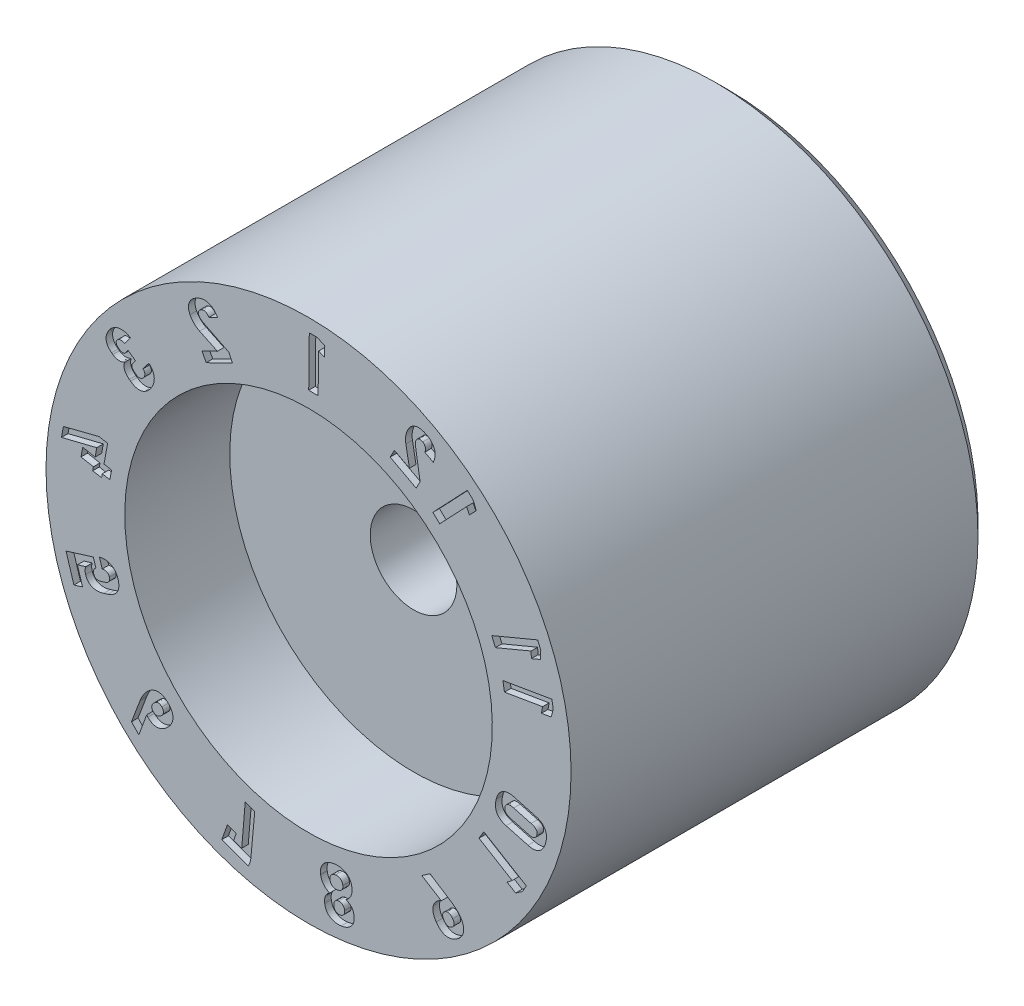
from build123d import *

# Parameters (mm, degrees)
CUT_EXTRUDE1_DEPTH = 0.25


with BuildPart() as part:
    # Sketch1 → Revolve1 (revolve)
    with BuildSketch(Plane.ZY, mode=Mode.PRIVATE) as revolve1_sk:
        Polygon((-16, -1.65), (-16, -9.5), (-15.5, -10), (0, -10), (0, -7), (-4, -7), (-4, -1.65), align=None)
    revolve(revolve1_sk.sketch.rotate(Axis((0, 0, 0), (0, 0, 1)), 180), axis=Axis((0, 0, 0), (0, 0, 1)))

    # Sketch2 → Cut-Extrude1 (cut)
    # profile 1 of 15: a face of its own
    with BuildSketch(Plane(origin=(0, 0, 0), x_dir=(0, -1, 0), z_dir=(0, 0, 1))):
        Polygon((-7.599640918, 0.006948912), (-7.595790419, 0.365699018), (-9.079364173, 0.382265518), (-8.988603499, 0.613487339), (-9.370275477, 0.617813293), (-9.501565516, 0.334727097), (-9.504884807, 0.028389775), align=None)
    # profile 2 of 15: a face of its own
    with BuildSketch(Plane(origin=(0, 0, 0), x_dir=(0, -1, 0), z_dir=(0, 0, 1))):
        with BuildLine():
            Line((-7.332171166, -3.037008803), (-7.814493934, -3.995477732))
            add(Edge.make_bspline(
                [(-7.814493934, -3.995477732), (-7.834430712, -4.036290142), (-7.865643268, -4.083637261), (-7.911667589, -4.13099786), (-7.941012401, -4.156108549), (-7.964546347, -4.171497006), (-7.98068849, -4.17961813)],
                knots=[0, 0, 0, 0, 0.540924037, 0.666718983, 0.785210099, 1, 1, 1, 1], degree=3))
            Line((-7.98068849, -4.17961813), (-7.983306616, -4.180588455))
            add(Edge.make_bspline(
                [(-7.983306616, -4.180588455), (-8.003975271, -4.191047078), (-8.037008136, -4.200881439), (-8.081517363, -4.198891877), (-8.112331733, -4.189110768), (-8.14087967, -4.171772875), (-8.178527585, -4.138422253), (-8.198111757, -4.103710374), (-8.210571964, -4.079738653)],
                knots=[0, 0, 0, 0, 0.246374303, 0.357484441, 0.468975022, 0.586096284, 0.710177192, 1, 1, 1, 1], degree=3))
            add(Edge.make_bspline(
                [(-8.210571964, -4.079738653), (-8.222393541, -4.055488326), (-8.234483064, -4.016580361), (-8.232696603, -3.963311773), (-8.222040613, -3.92525845), (-8.204140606, -3.888463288), (-8.167306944, -3.840413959), (-8.129861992, -3.811521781), (-8.102659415, -3.793965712)],
                knots=[0, 0, 0, 0, 0.239491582, 0.352314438, 0.467332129, 0.586809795, 0.712523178, 1, 1, 1, 1], degree=3))
            Line((-8.102659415, -3.793965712), (-8.101663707, -3.793253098))
            Line((-8.101663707, -3.793253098), (-8.262240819, -3.464742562))
            Line((-8.262240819, -3.464742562), (-8.263236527, -3.465455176))
            add(Edge.make_bspline(
                [(-8.263236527, -3.465455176), (-8.311490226, -3.493075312), (-8.378687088, -3.539920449), (-8.454070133, -3.61504344), (-8.499862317, -3.674090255), (-8.536650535, -3.736377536), (-8.563876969, -3.80156774), (-8.581095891, -3.86942359), (-8.588627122, -3.939507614), (-8.586117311, -4.011116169), (-8.570723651, -4.110175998), (-8.542633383, -4.181788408), (-8.520447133, -4.22848443)],
                knots=[0, 0, 0, 0, 0.185500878, 0.27133804, 0.354019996, 0.434024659, 0.511906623, 0.588797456, 0.666690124, 0.746155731, 0.827114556, 1, 1, 1, 1], degree=3))
            add(Edge.make_bspline(
                [(-8.520447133, -4.22848443), (-8.496222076, -4.277817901), (-8.455629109, -4.347313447), (-8.389281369, -4.427115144), (-8.337347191, -4.475666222), (-8.282204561, -4.514710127), (-8.224585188, -4.545279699), (-8.163356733, -4.56435168), (-8.100083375, -4.574959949), (-8.034541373, -4.574981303), (-7.942604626, -4.561030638), (-7.875100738, -4.536885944), (-7.83146343, -4.515199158)],
                knots=[0, 0, 0, 0, 0.194750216, 0.283308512, 0.36663251, 0.445697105, 0.521961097, 0.596530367, 0.671739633, 0.748345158, 0.827520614, 1, 1, 1, 1], degree=3))
            Line((-7.83146343, -4.515199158), (-7.830467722, -4.514486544))
            add(Edge.make_bspline(
                [(-7.830467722, -4.514486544), (-7.791608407, -4.49601555), (-7.736279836, -4.461860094), (-7.667686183, -4.408136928), (-7.619654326, -4.362382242), (-7.574650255, -4.313513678), (-7.521918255, -4.243419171), (-7.487343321, -4.187713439), (-7.468925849, -4.148228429)],
                knots=[0, 0, 0, 0, 0.245975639, 0.371149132, 0.498271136, 0.625429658, 0.751106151, 1, 1, 1, 1], degree=3))
            Line((-7.468925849, -4.148228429), (-7.14485061, -3.471052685))
            Line((-7.14485061, -3.471052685), (-6.860887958, -4.052754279))
            Line((-6.860887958, -4.052754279), (-6.55189721, -3.901931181))
            Line((-6.55189721, -3.901931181), (-7.043241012, -2.896025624))
            Line((-7.043241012, -2.896025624), (-7.332171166, -3.037008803))
        make_face()
    # profile 3 of 15: a face of its own
    with BuildSketch(Plane(origin=(0, 0, 0), x_dir=(0, -1, 0), z_dir=(0, 0, 1))):
        with BuildLine():
            Line((-5.445372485, -6.082693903), (-5.148320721, -6.304857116))
            add(Edge.make_bspline(
                [(-5.148320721, -6.304857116), (-5.135295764, -6.291504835), (-5.114509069, -6.273626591), (-5.084172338, -6.254814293), (-5.06122935, -6.244823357), (-5.038060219, -6.237794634), (-5.014667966, -6.234221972), (-4.991171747, -6.233242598), (-4.967586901, -6.235610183), (-4.944257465, -6.241296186), (-4.912908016, -6.253498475), (-4.890802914, -6.266687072), (-4.876871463, -6.277278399)],
                knots=[0, 0, 0, 0, 0.185321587, 0.271185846, 0.353768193, 0.433305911, 0.511128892, 0.588304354, 0.666454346, 0.745867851, 0.826198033, 1, 1, 1, 1], degree=3))
            add(Edge.make_bspline(
                [(-4.876871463, -6.277278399), (-4.852256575, -6.295355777), (-4.820074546, -6.326963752), (-4.793013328, -6.378157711), (-4.783247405, -6.417443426), (-4.782292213, -6.45793567), (-4.794995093, -6.515129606), (-4.817819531, -6.554639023), (-4.836319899, -6.579552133)],
                knots=[0, 0, 0, 0, 0.264915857, 0.382862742, 0.497043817, 0.612324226, 0.730419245, 1, 1, 1, 1], degree=3))
            Line((-4.836319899, -6.579552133), (-4.862855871, -6.615126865))
            add(Edge.make_bspline(
                [(-4.862855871, -6.615126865), (-4.882780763, -6.640528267), (-4.913244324, -6.676601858), (-4.963154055, -6.708606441), (-4.998817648, -6.723841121), (-5.035124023, -6.729348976), (-5.084629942, -6.726026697), (-5.11826157, -6.706919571), (-5.138535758, -6.692356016)],
                knots=[0, 0, 0, 0, 0.301107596, 0.428623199, 0.546089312, 0.65726331, 0.765523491, 1, 1, 1, 1], degree=3))
            Line((-5.138535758, -6.692356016), (-5.267642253, -6.595854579))
            Line((-5.267642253, -6.595854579), (-5.475030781, -6.872816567))
            Line((-5.475030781, -6.872816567), (-5.345924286, -6.969318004))
            add(Edge.make_bspline(
                [(-5.345924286, -6.969318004), (-5.329068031, -6.981334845), (-5.307893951, -7.004812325), (-5.294007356, -7.043553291), (-5.291136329, -7.074695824), (-5.295149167, -7.107732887), (-5.311322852, -7.15617477), (-5.332144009, -7.190553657), (-5.349119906, -7.212716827)],
                knots=[0, 0, 0, 0, 0.226456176, 0.333734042, 0.44465875, 0.565242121, 0.694773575, 1, 1, 1, 1], degree=3))
            Line((-5.349119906, -7.212716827), (-5.368521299, -7.238732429))
            add(Edge.make_bspline(
                [(-5.368521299, -7.238732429), (-5.384445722, -7.259427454), (-5.409907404, -7.288219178), (-5.451653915, -7.313095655), (-5.482329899, -7.323856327), (-5.513703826, -7.327126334), (-5.556997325, -7.321446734), (-5.586785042, -7.305176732), (-5.604745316, -7.291739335)],
                knots=[0, 0, 0, 0, 0.287243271, 0.411791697, 0.527494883, 0.639812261, 0.753406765, 1, 1, 1, 1], degree=3))
            add(Edge.make_bspline(
                [(-5.604745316, -7.291739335), (-5.617055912, -7.282108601), (-5.634359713, -7.266024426), (-5.651361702, -7.239789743), (-5.661253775, -7.218592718), (-5.668413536, -7.195868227), (-5.672634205, -7.171847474), (-5.674129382, -7.146497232), (-5.672154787, -7.119960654), (-5.667475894, -7.092443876), (-5.656323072, -7.053591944), (-5.644705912, -7.024695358), (-5.634904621, -7.00567567)],
                knots=[0, 0, 0, 0, 0.149750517, 0.222735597, 0.297357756, 0.372558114, 0.449624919, 0.529756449, 0.614461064, 0.703230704, 0.795895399, 1, 1, 1, 1], degree=3))
            Line((-5.634904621, -7.00567567), (-5.930868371, -6.784387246))
            add(Edge.make_bspline(
                [(-5.930868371, -6.784387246), (-5.959576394, -6.83138654), (-5.996187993, -6.904125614), (-6.025615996, -7.006014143), (-6.037271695, -7.080248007), (-6.039733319, -7.153261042), (-6.031924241, -7.224349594), (-6.015406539, -7.293018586), (-5.989006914, -7.358629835), (-5.955046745, -7.421065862), (-5.89668869, -7.498824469), (-5.843227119, -7.54958838), (-5.80323628, -7.578886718)],
                knots=[0, 0, 0, 0, 0.185347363, 0.2717601, 0.355594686, 0.437386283, 0.51661572, 0.595330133, 0.674074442, 0.753729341, 0.833596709, 1, 1, 1, 1], degree=3))
            add(Edge.make_bspline(
                [(-5.80323628, -7.578886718), (-5.771345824, -7.602875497), (-5.722304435, -7.634795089), (-5.654359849, -7.668754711), (-5.605138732, -7.688014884), (-5.556308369, -7.701569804), (-5.507901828, -7.710281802), (-5.459823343, -7.712819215), (-5.412394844, -7.710663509), (-5.365862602, -7.703058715), (-5.320858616, -7.689364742), (-5.276946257, -7.67126406), (-5.234882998, -7.647165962), (-5.194259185, -7.617880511), (-5.140461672, -7.570735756), (-5.104939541, -7.528610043), (-5.082245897, -7.498806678)],
                knots=[0, 0, 0, 0, 0.145014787, 0.212026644, 0.275758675, 0.336776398, 0.39593773, 0.454131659, 0.511359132, 0.568208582, 0.624972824, 0.681963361, 0.740474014, 0.800696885, 0.863706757, 1, 1, 1, 1], degree=3))
            Line((-5.082245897, -7.498806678), (-5.047700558, -7.452584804))
            add(Edge.make_bspline(
                [(-5.047700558, -7.452584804), (-5.022691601, -7.419347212), (-4.991606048, -7.365328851), (-4.969178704, -7.287040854), (-4.961368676, -7.228160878), (-4.963398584, -7.168841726), (-4.979394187, -7.088733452), (-5.005086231, -7.031863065), (-5.027228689, -6.996262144)],
                knots=[0, 0, 0, 0, 0.256338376, 0.378395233, 0.49923366, 0.620463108, 0.741960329, 1, 1, 1, 1], degree=3))
            add(Edge.make_bspline(
                [(-5.027228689, -6.996262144), (-5.006664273, -7.005995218), (-4.974513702, -7.01680935), (-4.930869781, -7.025395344), (-4.898620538, -7.029050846), (-4.866402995, -7.028404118), (-4.834149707, -7.025272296), (-4.801938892, -7.018712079), (-4.758908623, -7.005685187), (-4.706173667, -6.981011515), (-4.622446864, -6.925195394), (-4.570863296, -6.866062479), (-4.53828321, -6.824141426)],
                knots=[0, 0, 0, 0, 0.120783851, 0.179432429, 0.236283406, 0.292935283, 0.350395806, 0.408362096, 0.467374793, 0.589076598, 0.716315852, 1, 1, 1, 1], degree=3))
            Line((-4.53828321, -6.824141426), (-4.503737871, -6.777919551))
            add(Edge.make_bspline(
                [(-4.503737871, -6.777919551), (-4.473311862, -6.736047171), (-4.432237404, -6.671603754), (-4.398441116, -6.578748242), (-4.383893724, -6.511374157), (-4.380062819, -6.444515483), (-4.385762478, -6.378486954), (-4.402851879, -6.313680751), (-4.429944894, -6.250338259), (-4.467026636, -6.188767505), (-4.532623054, -6.108019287), (-4.592469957, -6.054264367), (-4.636763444, -6.021662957)],
                knots=[0, 0, 0, 0, 0.178322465, 0.259913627, 0.338341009, 0.414266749, 0.489149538, 0.565076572, 0.643478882, 0.72510618, 0.811155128, 1, 1, 1, 1], degree=3))
            add(Edge.make_bspline(
                [(-4.636763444, -6.021662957), (-4.680303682, -5.988108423), (-4.749949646, -5.946813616), (-4.847481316, -5.905682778), (-4.920136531, -5.885907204), (-4.992643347, -5.875560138), (-5.064347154, -5.875201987), (-5.13497085, -5.884768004), (-5.204086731, -5.904018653), (-5.27070676, -5.933772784), (-5.356801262, -5.987578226), (-5.411893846, -6.042611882), (-5.445372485, -6.082693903)],
                knots=[0, 0, 0, 0, 0.181568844, 0.266779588, 0.349602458, 0.430041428, 0.508528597, 0.586128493, 0.665194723, 0.745151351, 0.826792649, 1, 1, 1, 1], degree=3))
        make_face()
    # profile 4 of 15: a face of its own
    with BuildSketch(Plane(origin=(0, 0, 0), x_dir=(0, -1, 0), z_dir=(0, 0, 1))):
        Polygon((-2.07696125, -7.975767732), (-1.731706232, -9.337300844), (-1.333766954, -9.410040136), (-1.666200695, -8.066851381), (-1.325780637, -8.129308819), (-1.412513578, -8.602018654), (-1.060710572, -8.666466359), (-0.973995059, -8.193851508), (-0.82785895, -8.220663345), (-0.765588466, -7.881987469), (-0.911853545, -7.85516929), (-0.859048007, -7.567369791), (-1.210851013, -7.502922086), (-1.263646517, -7.790666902), (-2.017577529, -7.652431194), align=None)
    # profile 5 of 15: a face of its own
    with BuildSketch(Plane(origin=(0, 0, 0), x_dir=(0, -1, 0), z_dir=(0, 0, 1))):
        with BuildLine():
            Line((1.889300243, -7.963962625), (1.889698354, -7.965120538))
            Line((1.889698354, -7.965120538), (2.230541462, -7.859456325))
            Line((2.230541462, -7.859456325), (2.230143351, -7.858298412))
            add(Edge.make_bspline(
                [(2.230143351, -7.858298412), (2.223333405, -7.827208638), (2.21944767, -7.781128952), (2.227718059, -7.722265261), (2.241474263, -7.68421821), (2.261542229, -7.650709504), (2.298383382, -7.613431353), (2.333733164, -7.594828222), (2.359327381, -7.587423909)],
                knots=[0, 0, 0, 0, 0.286250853, 0.411970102, 0.532178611, 0.648041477, 0.760756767, 1, 1, 1, 1], degree=3))
            add(Edge.make_bspline(
                [(2.359327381, -7.587423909), (2.386315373, -7.578895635), (2.428237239, -7.57290569), (2.481714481, -7.584431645), (2.517099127, -7.60238921), (2.548648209, -7.628670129), (2.587764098, -7.676361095), (2.605980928, -7.72153341), (2.616218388, -7.753138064)],
                knots=[0, 0, 0, 0, 0.245943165, 0.357035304, 0.469046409, 0.5862071, 0.710396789, 1, 1, 1, 1], degree=3))
            Line((2.616218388, -7.753138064), (2.663105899, -7.904951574))
            add(Edge.make_bspline(
                [(2.663105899, -7.904951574), (2.672979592, -7.936674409), (2.683384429, -7.983684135), (2.68098579, -8.044560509), (2.671483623, -8.083135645), (2.655273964, -8.116958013), (2.622511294, -8.154770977), (2.588614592, -8.172720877), (2.56431795, -8.179877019)],
                knots=[0, 0, 0, 0, 0.302868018, 0.431900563, 0.550442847, 0.661671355, 0.769583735, 1, 1, 1, 1], degree=3))
            add(Edge.make_bspline(
                [(2.56431795, -8.179877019), (2.541492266, -8.18673655), (2.506421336, -8.19340666), (2.460081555, -8.189812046), (2.42758797, -8.181993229), (2.397233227, -8.168700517), (2.359605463, -8.143882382), (2.336337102, -8.1184738), (2.323715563, -8.099197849)],
                knots=[0, 0, 0, 0, 0.262338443, 0.385717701, 0.507592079, 0.627408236, 0.747450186, 1, 1, 1, 1], degree=3))
            Line((2.323715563, -8.099197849), (2.005343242, -8.197913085))
            Line((2.005343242, -8.197913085), (2.327529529, -9.237431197))
            Line((2.327529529, -9.237431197), (3.299020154, -8.93656229))
            Line((3.299020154, -8.93656229), (3.197192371, -8.608383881))
            Line((3.197192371, -8.608383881), (2.566544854, -8.803588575))
            Line((2.566544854, -8.803588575), (2.467739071, -8.483823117))
            add(Edge.make_bspline(
                [(2.467739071, -8.483823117), (2.48546724, -8.492376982), (2.514557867, -8.502520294), (2.556519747, -8.508820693), (2.591271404, -8.511067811), (2.627080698, -8.509806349), (2.674016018, -8.505888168), (2.708220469, -8.497879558), (2.730265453, -8.491189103)],
                knots=[0, 0, 0, 0, 0.220181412, 0.341690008, 0.473687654, 0.609113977, 0.742086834, 1, 1, 1, 1], degree=3))
            add(Edge.make_bspline(
                [(2.730265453, -8.491189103), (2.77400181, -8.477408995), (2.836722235, -8.450891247), (2.90771473, -8.398040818), (2.951834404, -8.35299069), (2.988378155, -8.302058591), (3.016254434, -8.244996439), (3.035503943, -8.182358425), (3.046293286, -8.114384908), (3.048342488, -8.041688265), (3.040732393, -7.934868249), (3.020703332, -7.854094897), (3.004184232, -7.799594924)],
                knots=[0, 0, 0, 0, 0.163580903, 0.239382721, 0.313637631, 0.38716286, 0.461531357, 0.538642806, 0.619556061, 0.7057246, 0.796949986, 1, 1, 1, 1], degree=3))
            Line((3.004184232, -7.799594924), (2.957296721, -7.647781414))
            add(Edge.make_bspline(
                [(2.957296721, -7.647781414), (2.940432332, -7.593335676), (2.909279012, -7.515656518), (2.851345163, -7.42428266), (2.803251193, -7.366940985), (2.749908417, -7.318698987), (2.691499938, -7.280044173), (2.627926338, -7.251557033), (2.559909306, -7.232505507), (2.487592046, -7.223635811), (2.383133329, -7.225387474), (2.304182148, -7.242326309), (2.251764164, -7.258757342)],
                knots=[0, 0, 0, 0, 0.186924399, 0.27222488, 0.353505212, 0.431383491, 0.507078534, 0.582001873, 0.658710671, 0.737652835, 0.819859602, 1, 1, 1, 1], degree=3))
            add(Edge.make_bspline(
                [(2.251764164, -7.258757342), (2.205504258, -7.273375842), (2.138590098, -7.301571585), (2.060071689, -7.355621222), (2.008496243, -7.402429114), (1.963921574, -7.455257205), (1.927799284, -7.514460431), (1.898691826, -7.578585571), (1.878892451, -7.648418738), (1.867745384, -7.722551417), (1.864849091, -7.828976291), (1.876676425, -7.909940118), (1.889300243, -7.963962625)],
                knots=[0, 0, 0, 0, 0.164951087, 0.244386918, 0.322686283, 0.400848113, 0.478265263, 0.557501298, 0.639295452, 0.72392502, 0.811482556, 1, 1, 1, 1], degree=3))
        make_face()
    # profile 6 of 15: a face of its own
    with BuildSketch(Plane(origin=(0, 0, 0), x_dir=(0, -1, 0), z_dir=(0, 0, 1))):
        with BuildLine():
            Line((5.40754392, -6.137031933), (5.408333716, -6.137790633))
            add(Edge.make_bspline(
                [(5.408333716, -6.137790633), (5.43294653, -6.163176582), (5.472969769, -6.199490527), (5.530752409, -6.244614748), (5.628335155, -6.312293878), (5.716861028, -6.359913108), (5.790662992, -6.392689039)],
                knots=[0, 0, 0, 0, 0.229425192, 0.35033143, 0.475684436, 1, 1, 1, 1], degree=3))
            add(Edge.make_bspline(
                [(5.790662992, -6.392689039), (5.803766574, -6.398175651), (5.829108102, -6.410108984), (5.855384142, -6.419827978), (5.868369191, -6.424434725)],
                knots=[0, 0, 0, 0, 0.507578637, 1, 1, 1, 1], degree=3))
            Line((5.868369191, -6.424434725), (6.713634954, -6.744007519))
            Line((6.713634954, -6.744007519), (7.004257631, -6.462815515))
            Line((7.004257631, -6.462815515), (6.19486723, -6.16526926))
            add(Edge.make_bspline(
                [(6.19486723, -6.16526926), (6.214384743, -6.152635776), (6.232482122, -6.137814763), (6.249182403, -6.121680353)],
                knots=[0.758085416, 0.758085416, 0.758085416, 0.758085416, 1, 1, 1, 1], degree=3))
            add(Edge.make_bspline(
                [(6.249182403, -6.121680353), (6.284565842, -6.088004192), (6.33015987, -6.032661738), (6.374983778, -5.950855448), (6.396501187, -5.888718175), (6.408913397, -5.825202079), (6.409997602, -5.760561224), (6.401653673, -5.695208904), (6.382869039, -5.629459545), (6.354479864, -5.563494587), (6.30204324, -5.47281037), (6.2495103, -5.410835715), (6.211253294, -5.370731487)],
                knots=[0, 0, 0, 0, 0.171552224, 0.250175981, 0.326701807, 0.401808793, 0.476742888, 0.552955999, 0.6326332, 0.716300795, 0.804840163, 1, 1, 1, 1], degree=3))
            Line((6.211253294, -5.370731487), (6.210068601, -5.369593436))
            add(Edge.make_bspline(
                [(6.210068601, -5.369593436), (6.17107201, -5.328139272), (6.107769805, -5.274135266), (6.015580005, -5.218301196), (5.946898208, -5.188964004), (5.877733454, -5.169799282), (5.808219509, -5.161796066), (5.738833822, -5.164096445), (5.669860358, -5.178424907), (5.601774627, -5.20283145), (5.509702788, -5.251319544), (5.447248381, -5.302005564), (5.407804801, -5.340004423)],
                knots=[0, 0, 0, 0, 0.186949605, 0.27196259, 0.353438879, 0.431722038, 0.507097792, 0.582641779, 0.658968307, 0.737737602, 0.819719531, 1, 1, 1, 1], degree=3))
            add(Edge.make_bspline(
                [(5.407804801, -5.340004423), (5.368689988, -5.377898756), (5.316369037, -5.438318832), (5.264373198, -5.527938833), (5.237699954, -5.59506122), (5.22123938, -5.663203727), (5.216019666, -5.732072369), (5.221409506, -5.801155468), (5.237322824, -5.870417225), (5.264280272, -5.939120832), (5.316032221, -6.032528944), (5.36810365, -6.096697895), (5.40754392, -6.137031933)],
                knots=[0, 0, 0, 0, 0.180435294, 0.262660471, 0.34194499, 0.418744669, 0.493877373, 0.569633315, 0.647321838, 0.728297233, 0.813160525, 1, 1, 1, 1], degree=3))
        make_face()
        with BuildLine():
            Line((5.937451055, -5.60240116), (5.938635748, -5.60353921))
            add(Edge.make_bspline(
                [(5.938635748, -5.60353921), (5.962675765, -5.628645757), (5.994780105, -5.667836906), (6.01964139, -5.726865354), (6.028278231, -5.768201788), (6.027253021, -5.808716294), (6.01237163, -5.862394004), (5.985867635, -5.896625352), (5.965450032, -5.916697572)],
                knots=[0, 0, 0, 0, 0.294172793, 0.419084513, 0.536108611, 0.647083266, 0.757101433, 1, 1, 1, 1], degree=3))
            add(Edge.make_bspline(
                [(5.965450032, -5.916697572), (5.945030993, -5.936164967), (5.909979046, -5.961216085), (5.855843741, -5.973507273), (5.814954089, -5.973160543), (5.773681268, -5.962541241), (5.715659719, -5.935245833), (5.677730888, -5.901755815), (5.653285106, -5.877267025)],
                knots=[0, 0, 0, 0, 0.239606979, 0.350713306, 0.462757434, 0.580918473, 0.706867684, 1, 1, 1, 1], degree=3))
            Line((5.653285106, -5.877267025), (5.652495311, -5.876508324))
            add(Edge.make_bspline(
                [(5.652495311, -5.876508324), (5.631971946, -5.85438999), (5.60386385, -5.819707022), (5.584427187, -5.766486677), (5.579009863, -5.728347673), (5.583153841, -5.690584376), (5.600934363, -5.63988802), (5.62717274, -5.607157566), (5.64747036, -5.587698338)],
                knots=[0, 0, 0, 0, 0.277690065, 0.398448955, 0.513505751, 0.626362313, 0.741961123, 1, 1, 1, 1], degree=3))
            add(Edge.make_bspline(
                [(5.64747036, -5.587698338), (5.667633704, -5.567395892), (5.701875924, -5.54285966), (5.75353932, -5.526295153), (5.79162704, -5.524137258), (5.829800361, -5.530628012), (5.88246468, -5.55173791), (5.916310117, -5.580886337), (5.937451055, -5.60240116)],
                knots=[0, 0, 0, 0, 0.260088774, 0.374782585, 0.488633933, 0.603177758, 0.72405985, 1, 1, 1, 1], degree=3))
        make_face(mode=Mode.SUBTRACT)
    # profile 7 of 15: a face of its own
    with BuildSketch(Plane(origin=(0, 0, 0), x_dir=(0, -1, 0), z_dir=(0, 0, 1))):
        Polygon((9.020358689, -2.20509202), (7.318974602, -2.047586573), (7.189055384, -2.411581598), (8.785442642, -2.545174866), (8.676065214, -2.851211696), (8.407786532, -2.755201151), (8.287991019, -3.091070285), (8.879864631, -3.302650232), (9.243494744, -2.284704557), align=None)
    # profile 8 of 15: a face of its own
    with BuildSketch(Plane(origin=(0, 0, 0), x_dir=(0, -1, 0), z_dir=(0, 0, 1))):
        with BuildLine():
            Line((8.137029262, 0.460373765), (8.167914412, 0.464313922))
            add(Edge.make_bspline(
                [(8.167914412, 0.464313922), (8.214303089, 0.469637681), (8.281903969, 0.489843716), (8.365775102, 0.533083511), (8.423857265, 0.575480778), (8.476543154, 0.624611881), (8.535423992, 0.699684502), (8.568306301, 0.763275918), (8.582802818, 0.808577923)],
                knots=[0, 0, 0, 0, 0.245873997, 0.369722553, 0.497260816, 0.624850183, 0.749381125, 1, 1, 1, 1], degree=3))
            add(Edge.make_bspline(
                [(8.582802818, 0.808577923), (8.604938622, 0.774649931), (8.644994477, 0.728764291), (8.708941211, 0.679580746), (8.760870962, 0.64954098), (8.815427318, 0.626546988), (8.890205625, 0.608223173), (8.94763842, 0.606116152), (8.985211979, 0.611715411)],
                knots=[0, 0, 0, 0, 0.257462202, 0.383888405, 0.51183656, 0.638238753, 0.759243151, 1, 1, 1, 1], degree=3))
            Line((8.985211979, 0.611715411), (9.034480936, 0.617971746))
            add(Edge.make_bspline(
                [(9.034480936, 0.617971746), (9.081218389, 0.623691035), (9.14879976, 0.641417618), (9.231081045, 0.681780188), (9.285521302, 0.719910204), (9.333353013, 0.765522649), (9.374573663, 0.817441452), (9.407751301, 0.876101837), (9.433868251, 0.940247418), (9.452193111, 1.009472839), (9.464805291, 1.110342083), (9.462111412, 1.18834554), (9.454810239, 1.240886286)],
                knots=[0, 0, 0, 0, 0.166920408, 0.24562204, 0.324151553, 0.401797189, 0.479414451, 0.5585348, 0.640110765, 0.724597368, 0.811872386, 1, 1, 1, 1], degree=3))
            add(Edge.make_bspline(
                [(9.454810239, 1.240886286), (9.447289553, 1.293145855), (9.431347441, 1.369691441), (9.391690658, 1.463231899), (9.35678133, 1.525787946), (9.314517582, 1.580724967), (9.267450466, 1.628607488), (9.214335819, 1.667954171), (9.15645965, 1.69944715), (9.093797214, 1.721807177), (9.004116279, 1.740787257), (8.933998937, 1.739134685), (8.887515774, 1.733057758)],
                knots=[0, 0, 0, 0, 0.187940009, 0.275344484, 0.360030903, 0.44165333, 0.520785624, 0.597734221, 0.675551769, 0.753950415, 0.833210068, 1, 1, 1, 1], degree=3))
            Line((8.887515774, 1.733057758), (8.838246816, 1.726801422))
            add(Edge.make_bspline(
                [(8.838246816, 1.726801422), (8.800106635, 1.722010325), (8.744391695, 1.705245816), (8.676372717, 1.667458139), (8.629909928, 1.630237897), (8.587253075, 1.587636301), (8.53939632, 1.522038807), (8.512888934, 1.466873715), (8.501071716, 1.427771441)],
                knots=[0, 0, 0, 0, 0.242029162, 0.363319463, 0.48911611, 0.616671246, 0.742842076, 1, 1, 1, 1], degree=3))
            add(Edge.make_bspline(
                [(8.501071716, 1.427771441), (8.473943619, 1.46709586), (8.427182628, 1.522583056), (8.349272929, 1.578862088), (8.286232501, 1.614056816), (8.218984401, 1.639778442), (8.127390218, 1.662493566), (8.056496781, 1.662140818), (8.010486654, 1.656617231)],
                knots=[0, 0, 0, 0, 0.252401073, 0.377133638, 0.504621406, 0.631738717, 0.755354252, 1, 1, 1, 1], degree=3))
            Line((8.010486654, 1.656617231), (7.979601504, 1.652677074))
            add(Edge.make_bspline(
                [(7.979601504, 1.652677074), (7.930085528, 1.646338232), (7.85829985, 1.627720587), (7.770981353, 1.584832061), (7.713782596, 1.543754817), (7.662702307, 1.495873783), (7.619820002, 1.440250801), (7.584358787, 1.377943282), (7.557422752, 1.30915838), (7.53819908, 1.235037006), (7.524075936, 1.127189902), (7.528662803, 1.043665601), (7.53557917, 0.987444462)],
                knots=[0, 0, 0, 0, 0.1662813, 0.245020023, 0.322996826, 0.400171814, 0.477620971, 0.556199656, 0.638392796, 0.723135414, 0.810891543, 1, 1, 1, 1], degree=3))
            add(Edge.make_bspline(
                [(7.53557917, 0.987444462), (7.542696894, 0.931209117), (7.560978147, 0.849705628), (7.60241227, 0.749146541), (7.639856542, 0.682390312), (7.68381622, 0.623048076), (7.734193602, 0.572193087), (7.790159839, 0.529543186), (7.85187029, 0.496190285), (7.917900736, 0.471591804), (8.013280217, 0.452573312), (8.087529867, 0.453914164), (8.137029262, 0.460373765)],
                knots=[0, 0, 0, 0, 0.188969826, 0.276571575, 0.361700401, 0.443462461, 0.52195862, 0.599529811, 0.677129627, 0.754933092, 0.833532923, 1, 1, 1, 1], degree=3))
        make_face()
        with BuildLine():
            Line((8.078108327, 1.304827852), (8.09600414, 1.30739245))
            add(Edge.make_bspline(
                [(8.09600414, 1.30739245), (8.116106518, 1.310697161), (8.146221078, 1.310107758), (8.185042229, 1.302642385), (8.211656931, 1.292120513), (8.236688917, 1.278825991), (8.258994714, 1.261133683), (8.27979274, 1.240932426), (8.297596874, 1.216860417), (8.312816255, 1.189954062), (8.329990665, 1.149474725), (8.336862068, 1.116328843), (8.340212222, 1.093672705)],
                knots=[0, 0, 0, 0, 0.16669051, 0.246112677, 0.323892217, 0.40126476, 0.478432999, 0.55727091, 0.639208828, 0.723761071, 0.811152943, 1, 1, 1, 1], degree=3))
            add(Edge.make_bspline(
                [(8.340212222, 1.093672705), (8.343127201, 1.071017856), (8.344744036, 1.037216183), (8.338976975, 0.993615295), (8.331211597, 0.963516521), (8.319824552, 0.935833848), (8.305519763, 0.910434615), (8.287750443, 0.887797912), (8.266889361, 0.868010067), (8.243303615, 0.851222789), (8.207743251, 0.833779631), (8.178623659, 0.826013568), (8.158509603, 0.823641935)],
                knots=[0, 0, 0, 0, 0.187429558, 0.275451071, 0.359683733, 0.441509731, 0.520154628, 0.597919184, 0.676478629, 0.755123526, 0.834279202, 1, 1, 1, 1], degree=3))
            Line((8.158509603, 0.823641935), (8.138901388, 0.821334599))
            add(Edge.make_bspline(
                [(8.138901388, 0.821334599), (8.117270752, 0.817753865), (8.085059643, 0.818148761), (8.043294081, 0.824823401), (8.014393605, 0.834747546), (7.987554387, 0.848565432), (7.962680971, 0.865269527), (7.940759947, 0.88596687), (7.921553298, 0.909856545), (7.905604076, 0.937045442), (7.887287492, 0.977095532), (7.880244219, 1.010189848), (7.8771657, 1.032609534)],
                knots=[0, 0, 0, 0, 0.17286694, 0.25386239, 0.334267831, 0.413835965, 0.492611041, 0.570906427, 0.651843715, 0.734729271, 0.820133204, 1, 1, 1, 1], degree=3))
            add(Edge.make_bspline(
                [(7.8771657, 1.032609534), (7.873810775, 1.055109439), (7.873383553, 1.088780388), (7.880201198, 1.13229211), (7.889184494, 1.162526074), (7.901442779, 1.190820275), (7.917973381, 1.216239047), (7.937654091, 1.23908687), (7.960532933, 1.259248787), (7.986372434, 1.275991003), (8.02456429, 1.294984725), (8.056550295, 1.301604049), (8.078108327, 1.304827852)],
                knots=[0, 0, 0, 0, 0.179137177, 0.263849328, 0.346610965, 0.427374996, 0.50626182, 0.584852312, 0.66468001, 0.74595602, 0.827180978, 1, 1, 1, 1], degree=3))
        make_face(mode=Mode.SUBTRACT)
        with BuildLine():
            Line((8.87044507, 1.370002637), (8.88870909, 1.372687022))
            add(Edge.make_bspline(
                [(8.88870909, 1.372687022), (8.907427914, 1.374793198), (8.935574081, 1.376366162), (8.971417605, 1.369069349), (8.996344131, 1.36165957), (9.019328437, 1.350454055), (9.040275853, 1.336494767), (9.059006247, 1.319333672), (9.075642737, 1.299618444), (9.089549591, 1.276967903), (9.104296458, 1.242758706), (9.111257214, 1.215046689), (9.113591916, 1.195841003)],
                knots=[0, 0, 0, 0, 0.176372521, 0.258700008, 0.339762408, 0.417993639, 0.495919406, 0.573463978, 0.65383693, 0.735485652, 0.820064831, 1, 1, 1, 1], degree=3))
            add(Edge.make_bspline(
                [(9.113591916, 1.195841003), (9.116285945, 1.176699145), (9.116895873, 1.148100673), (9.111374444, 1.111162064), (9.103582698, 1.085737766), (9.092994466, 1.0620572), (9.078808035, 1.040785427), (9.062379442, 1.021283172), (9.042505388, 1.0047251), (9.020423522, 0.990591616), (8.986906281, 0.975422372), (8.959759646, 0.968199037), (8.940751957, 0.966153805)],
                knots=[0, 0, 0, 0, 0.178886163, 0.263391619, 0.345004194, 0.424566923, 0.502824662, 0.581173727, 0.660014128, 0.741521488, 0.823405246, 1, 1, 1, 1], degree=3))
            Line((8.940751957, 0.966153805), (8.921511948, 0.963966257))
            add(Edge.make_bspline(
                [(8.921511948, 0.963966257), (8.901841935, 0.961061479), (8.872608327, 0.960624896), (8.834706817, 0.965952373), (8.808582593, 0.973853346), (8.784083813, 0.984735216), (8.761559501, 0.99849432), (8.741666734, 1.015614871), (8.724077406, 1.035306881), (8.709515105, 1.057915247), (8.693468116, 1.091920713), (8.686400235, 1.119863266), (8.68412778, 1.139188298)],
                knots=[0, 0, 0, 0, 0.179228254, 0.262659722, 0.344810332, 0.424891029, 0.504315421, 0.582306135, 0.661155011, 0.742046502, 0.82433766, 1, 1, 1, 1], degree=3))
            add(Edge.make_bspline(
                [(8.68412778, 1.139188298), (8.681385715, 1.158348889), (8.680717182, 1.187083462), (8.68756866, 1.223934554), (8.696360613, 1.249241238), (8.707420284, 1.273231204), (8.723044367, 1.294346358), (8.740687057, 1.314029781), (8.762234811, 1.330406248), (8.785562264, 1.345243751), (8.821507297, 1.360369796), (8.850235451, 1.367917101), (8.87044507, 1.370002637)],
                knots=[0, 0, 0, 0, 0.173858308, 0.255853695, 0.3354019, 0.414134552, 0.492060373, 0.570450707, 0.650797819, 0.734328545, 0.818212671, 1, 1, 1, 1], degree=3))
        make_face(mode=Mode.SUBTRACT)
    # profile 9 of 15: a face of its own
    with BuildSketch(Plane(origin=(0, 0, 0), x_dir=(0, -1, 0), z_dir=(0, 0, 1))):
        with BuildLine():
            Line((7.511658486, 4.860977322), (7.513119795, 4.86172781))
            add(Edge.make_bspline(
                [(7.513119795, 4.86172781), (7.560560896, 4.894178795), (7.62540449, 4.948029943), (7.69630665, 5.030649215), (7.737390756, 5.093756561), (7.767480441, 5.159314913), (7.787404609, 5.226859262), (7.795973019, 5.296233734), (7.794161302, 5.367120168), (7.780858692, 5.438920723), (7.747774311, 5.538353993), (7.707719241, 5.608783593), (7.676726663, 5.654284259)],
                knots=[0, 0, 0, 0, 0.187469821, 0.273143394, 0.354214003, 0.43221498, 0.507589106, 0.582962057, 0.6592416, 0.7379537, 0.820209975, 1, 1, 1, 1], degree=3))
            add(Edge.make_bspline(
                [(7.676726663, 5.654284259), (7.64632036, 5.700086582), (7.593361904, 5.760503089), (7.512890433, 5.827066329), (7.449712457, 5.863797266), (7.383978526, 5.89124071), (7.315331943, 5.906636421), (7.244745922, 5.912820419), (7.172135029, 5.906920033), (7.098020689, 5.891155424), (6.994808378, 5.85379074), (6.921380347, 5.811289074), (6.87357403, 5.778592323)],
                knots=[0, 0, 0, 0, 0.178234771, 0.259637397, 0.338301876, 0.414869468, 0.490216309, 0.566018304, 0.644300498, 0.726036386, 0.81161072, 1, 1, 1, 1], degree=3))
            Line((6.87357403, 5.778592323), (6.872112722, 5.777841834))
            add(Edge.make_bspline(
                [(6.872112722, 5.777841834), (6.844951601, 5.758525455), (6.80470585, 5.726886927), (6.754731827, 5.678370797), (6.716717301, 5.637465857), (6.678919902, 5.592615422), (6.626583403, 5.526606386), (6.588833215, 5.474054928), (6.563903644, 5.437650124)],
                knots=[0, 0, 0, 0, 0.216736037, 0.331977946, 0.452460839, 0.579604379, 0.71315568, 1, 1, 1, 1], degree=3))
            add(Edge.make_bspline(
                [(6.563903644, 5.437650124), (6.556784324, 5.426687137), (6.541597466, 5.405693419), (6.527427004, 5.383995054), (6.520764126, 5.373019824)],
                knots=[0, 0, 0, 0, 0.504424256, 1, 1, 1, 1], degree=3))
            Line((6.520764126, 5.373019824), (6.041096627, 4.627132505))
            Line((6.041096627, 4.627132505), (6.257179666, 4.313664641))
            Line((6.257179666, 4.313664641), (6.718040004, 5.057546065))
            add(Edge.make_bspline(
                [(6.718040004, 5.057546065), (6.718606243, 5.055699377), (6.723091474, 5.041507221), (6.738700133, 5.001115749), (6.760052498, 4.965468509), (6.775953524, 4.942053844)],
                knots=[0.562907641, 0.562907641, 0.562907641, 0.562907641, 0.582426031, 0.71330413, 1, 1, 1, 1], degree=3))
            add(Edge.make_bspline(
                [(6.775953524, 4.942053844), (6.80198953, 4.904584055), (6.846769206, 4.853203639), (6.919125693, 4.800804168), (6.977017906, 4.771332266), (7.038219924, 4.750401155), (7.102232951, 4.738389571), (7.168766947, 4.736213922), (7.237173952, 4.74278272), (7.306553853, 4.758489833), (7.40144731, 4.792476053), (7.468254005, 4.83163795), (7.511658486, 4.860977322)],
                knots=[0, 0, 0, 0, 0.164733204, 0.243043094, 0.320867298, 0.398148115, 0.475570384, 0.554853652, 0.637425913, 0.722764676, 0.810743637, 1, 1, 1, 1], degree=3))
        make_face()
        with BuildLine():
            Line((7.090603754, 5.490849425), (7.09169643, 5.491718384))
            add(Edge.make_bspline(
                [(7.09169643, 5.491718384), (7.117976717, 5.510198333), (7.159397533, 5.53185581), (7.217536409, 5.545161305), (7.25781279, 5.544740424), (7.295780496, 5.535515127), (7.344276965, 5.510519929), (7.372987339, 5.479390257), (7.388903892, 5.455988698)],
                knots=[0, 0, 0, 0, 0.2836562, 0.407176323, 0.522864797, 0.635948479, 0.749089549, 1, 1, 1, 1], degree=3))
            add(Edge.make_bspline(
                [(7.388903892, 5.455988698), (7.405526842, 5.432304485), (7.424366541, 5.39376078), (7.431005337, 5.338884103), (7.425715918, 5.299801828), (7.411421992, 5.261997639), (7.378338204, 5.212127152), (7.343221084, 5.181146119), (7.316390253, 5.163282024)],
                knots=[0, 0, 0, 0, 0.25396243, 0.366761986, 0.479368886, 0.595910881, 0.717631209, 1, 1, 1, 1], degree=3))
            Line((7.316390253, 5.163282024), (7.315297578, 5.162413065))
            add(Edge.make_bspline(
                [(7.315297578, 5.162413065), (7.287546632, 5.144598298), (7.245844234, 5.119450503), (7.185699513, 5.106788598), (7.144573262, 5.10588294), (7.105536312, 5.114692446), (7.055760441, 5.139492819), (7.026370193, 5.171179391), (7.010164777, 5.19499588)],
                knots=[0, 0, 0, 0, 0.286687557, 0.409653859, 0.525636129, 0.638334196, 0.750719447, 1, 1, 1, 1], degree=3))
            add(Edge.make_bspline(
                [(7.010164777, 5.19499588), (6.994134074, 5.2183087), (6.975127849, 5.256605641), (6.970345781, 5.311512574), (6.976480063, 5.350966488), (6.99208933, 5.389133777), (7.02546629, 5.441024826), (7.063845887, 5.471370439), (7.090603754, 5.490849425)],
                knots=[0, 0, 0, 0, 0.245772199, 0.358139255, 0.470980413, 0.587123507, 0.711724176, 1, 1, 1, 1], degree=3))
        make_face(mode=Mode.SUBTRACT)
    # profile 10 of 15: a face of its own
    with BuildSketch(Plane(origin=(0, 0, 0), x_dir=(0, -1, 0), z_dir=(0, 0, 1))):
        Polygon((3.631862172, 6.676045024), (3.938126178, 6.491893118), (4.69870887, 7.756085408), (4.851162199, 7.562112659), (5.046570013, 7.887282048), (4.870252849, 8.142323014), (4.608897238, 8.299634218), align=None)
    # profile 11 of 15: a face of its own
    with BuildSketch(Plane(origin=(0, 0, 0), x_dir=(0, -1, 0), z_dir=(0, 0, 1))):
        with BuildLine():
            Line((3.008853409, 7.522695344), (3.235084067, 8.359949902))
            add(Edge.make_bspline(
                [(3.235084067, 8.359949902), (3.245546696, 8.399128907), (3.256866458, 8.457591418), (3.262606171, 8.534981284), (3.260356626, 8.589391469), (3.252972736, 8.641447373), (3.240720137, 8.691315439), (3.222438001, 8.738800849), (3.19915993, 8.784074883), (3.17018422, 8.826335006), (3.136343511, 8.865757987), (3.097494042, 8.902011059), (3.052755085, 8.934171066), (3.003601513, 8.964046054), (2.928549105, 8.999763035), (2.868002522, 9.020562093), (2.825743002, 9.031788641)],
                knots=[0, 0, 0, 0, 0.135733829, 0.198831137, 0.259399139, 0.31767141, 0.37462448, 0.430931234, 0.487646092, 0.544689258, 0.602065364, 0.661305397, 0.722119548, 0.786221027, 0.853655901, 1, 1, 1, 1], degree=3))
            add(Edge.make_bspline(
                [(2.825743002, 9.031788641), (2.783389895, 9.043310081), (2.720505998, 9.056518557), (2.637535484, 9.063419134), (2.579957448, 9.062987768), (2.525181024, 9.05720048), (2.473361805, 9.045622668), (2.424018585, 9.029719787), (2.378067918, 9.007211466), (2.335287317, 8.979916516), (2.29555356, 8.948199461), (2.259602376, 8.911416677), (2.22737351, 8.869686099), (2.198468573, 8.823457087), (2.163289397, 8.753947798), (2.144297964, 8.697111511), (2.133362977, 8.657841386)],
                knots=[0, 0, 0, 0, 0.146794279, 0.214109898, 0.27799967, 0.339036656, 0.397877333, 0.455243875, 0.511944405, 0.568412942, 0.624625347, 0.681540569, 0.739936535, 0.800569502, 0.863571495, 1, 1, 1, 1], degree=3))
            Line((2.133362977, 8.657841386), (1.907132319, 7.820586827))
            add(Edge.make_bspline(
                [(1.907132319, 7.820586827), (1.89666963, 7.781407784), (1.88535004, 7.722945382), (1.879610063, 7.645555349), (1.881860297, 7.591145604), (1.889241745, 7.539088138), (1.901503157, 7.489225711), (1.919752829, 7.441719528), (1.94318143, 7.396468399), (1.971741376, 7.353868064), (2.00559352, 7.314357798), (2.045016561, 7.278597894), (2.089302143, 7.245871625), (2.138584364, 7.216140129), (2.213428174, 7.180252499), (2.274356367, 7.160370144), (2.316473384, 7.148748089)],
                knots=[0, 0, 0, 0, 0.135706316, 0.198790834, 0.259346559, 0.317607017, 0.374548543, 0.430843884, 0.487547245, 0.544786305, 0.602150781, 0.66126366, 0.722560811, 0.786218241, 0.853639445, 1, 1, 1, 1], degree=3))
            add(Edge.make_bspline(
                [(2.316473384, 7.148748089), (2.358805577, 7.136775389), (2.42186979, 7.124626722), (2.504917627, 7.11728965), (2.562546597, 7.118394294), (2.617394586, 7.123863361), (2.66919788, 7.136079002), (2.718352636, 7.153048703), (2.764537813, 7.175724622), (2.807383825, 7.203253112), (2.846980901, 7.235433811), (2.882745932, 7.27232129), (2.915390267, 7.313578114), (2.944512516, 7.359138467), (2.978936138, 7.428013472), (2.99867407, 7.483695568), (3.008853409, 7.522695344)],
                knots=[0, 0, 0, 0, 0.147190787, 0.214626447, 0.278832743, 0.339978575, 0.398870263, 0.456661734, 0.513809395, 0.570752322, 0.626890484, 0.684320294, 0.742477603, 0.802826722, 0.865076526, 1, 1, 1, 1], degree=3))
        make_face()
        with BuildLine():
            Line((2.278185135, 7.815567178), (2.456628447, 8.475356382))
            add(Edge.make_bspline(
                [(2.456628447, 8.475356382), (2.467592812, 8.514979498), (2.487263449, 8.570676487), (2.526876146, 8.633610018), (2.554474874, 8.66329333), (2.57873698, 8.681371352), (2.597655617, 8.692223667), (2.618108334, 8.699756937), (2.6394409, 8.704879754), (2.661919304, 8.707431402), (2.694278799, 8.706927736), (2.718835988, 8.702265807), (2.735260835, 8.697752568)],
                knots=[0, 0, 0, 0, 0.304408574, 0.431797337, 0.547028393, 0.601171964, 0.654843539, 0.707489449, 0.761565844, 0.816558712, 0.874111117, 1, 1, 1, 1], degree=3))
            add(Edge.make_bspline(
                [(2.735260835, 8.697752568), (2.751500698, 8.692832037), (2.775427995, 8.685305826), (2.80335257, 8.668750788), (2.821780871, 8.655614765), (2.83777654, 8.640432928), (2.850907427, 8.623220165), (2.862676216, 8.604821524), (2.873976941, 8.576573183), (2.883308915, 8.537037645), (2.885863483, 8.462563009), (2.875746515, 8.404422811), (2.864375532, 8.364792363)],
                knots=[0, 0, 0, 0, 0.125752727, 0.182944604, 0.238821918, 0.292439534, 0.344834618, 0.39822355, 0.4529537, 0.568398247, 0.695928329, 1, 1, 1, 1], degree=3))
            Line((2.864375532, 8.364792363), (2.68593222, 7.705003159))
            add(Edge.make_bspline(
                [(2.68593222, 7.705003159), (2.674781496, 7.665483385), (2.655647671, 7.609620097), (2.615423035, 7.547116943), (2.587573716, 7.517816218), (2.563316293, 7.499688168), (2.544398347, 7.488808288), (2.524010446, 7.481437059), (2.502781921, 7.475797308), (2.480222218, 7.473737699), (2.447782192, 7.474046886), (2.423206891, 7.478838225), (2.406788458, 7.483305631)],
                knots=[0, 0, 0, 0, 0.30456185, 0.431162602, 0.546723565, 0.600894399, 0.654592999, 0.707265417, 0.760649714, 0.816466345, 0.874047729, 1, 1, 1, 1], degree=3))
            add(Edge.make_bspline(
                [(2.406788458, 7.483305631), (2.39054438, 7.488219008), (2.366629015, 7.495765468), (2.338796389, 7.512224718), (2.320510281, 7.525353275), (2.304597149, 7.540577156), (2.291166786, 7.557578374), (2.279737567, 7.576205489), (2.268459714, 7.604198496), (2.258708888, 7.643512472), (2.257154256, 7.717891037), (2.266547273, 7.775918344), (2.278185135, 7.815567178)],
                knots=[0, 0, 0, 0, 0.126014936, 0.183326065, 0.238377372, 0.292106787, 0.345479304, 0.39816533, 0.453009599, 0.56797277, 0.695294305, 1, 1, 1, 1], degree=3))
        make_face(mode=Mode.SUBTRACT)
    # profile 12 of 15: a face of its own
    with BuildSketch(Plane(origin=(0, 0, 0), x_dir=(0, -1, 0), z_dir=(0, 0, 1))):
        Polygon((-1.720166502, 7.403470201), (-1.36814875, 7.46330476), (-1.614514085, 8.916190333), (-1.373062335, 8.868912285), (-1.436508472, 9.24204231), (-1.736514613, 9.321016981), (-2.036826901, 9.269771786), align=None)
    # profile 13 of 15: a face of its own
    with BuildSketch(Plane(origin=(0, 0, 0), x_dir=(0, -1, 0), z_dir=(0, 0, 1))):
        Polygon((-2.99201183, 6.980449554), (-2.66308613, 7.118143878), (-3.23159922, 8.478599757), (-2.984970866, 8.486899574), (-3.131291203, 8.836433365), (-3.441465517, 8.845214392), (-3.722487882, 8.727636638), align=None)
    # profile 14 of 15: a face of its own
    with BuildSketch(Plane(origin=(0, 0, 0), x_dir=(0, -1, 0), z_dir=(0, 0, 1))):
        Polygon((-5.934268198, 4.734680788), (-5.686579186, 4.995692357), (-6.764335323, 6.019032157), (-6.540553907, 6.127391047), (-6.817760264, 6.390253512), (-7.107216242, 6.271884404), (-7.318754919, 6.049100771), align=None)
    # profile 15 of 15: a face of its own
    with BuildSketch(Plane(origin=(0, 0, 0), x_dir=(0, -1, 0), z_dir=(0, 0, 1))):
        with BuildLine():
            Line((-6.700198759, 4.249496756), (-7.760957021, 4.077680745))
            add(Edge.make_bspline(
                [(-7.760957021, 4.077680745), (-7.805811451, 4.070604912), (-7.86260497, 4.067006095), (-7.927863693, 4.076880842), (-7.96559273, 4.085510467), (-7.991866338, 4.096059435), (-8.008162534, 4.104320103)],
                knots=[0, 0, 0, 0, 0.541086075, 0.665754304, 0.782974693, 1, 1, 1, 1], degree=3))
            Line((-8.008162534, 4.104320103), (-8.010445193, 4.105559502))
            add(Edge.make_bspline(
                [(-8.010445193, 4.105559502), (-8.030783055, 4.116438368), (-8.058476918, 4.137160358), (-8.083001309, 4.174532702), (-8.093097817, 4.205331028), (-8.095956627, 4.238548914), (-8.090422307, 4.288422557), (-8.0753168, 4.325011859), (-8.062350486, 4.348910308)],
                knots=[0, 0, 0, 0, 0.245873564, 0.358403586, 0.469926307, 0.586616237, 0.710080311, 1, 1, 1, 1], degree=3))
            add(Edge.make_bspline(
                [(-8.062350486, 4.348910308), (-8.049505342, 4.372945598), (-8.024980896, 4.405856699), (-7.980535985, 4.435612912), (-7.943706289, 4.449736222), (-7.903157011, 4.456098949), (-7.842597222, 4.454985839), (-7.796971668, 4.441604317), (-7.766885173, 4.429661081)],
                knots=[0, 0, 0, 0, 0.241468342, 0.353131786, 0.468071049, 0.586792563, 0.713262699, 1, 1, 1, 1], degree=3))
            Line((-7.766885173, 4.429661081), (-7.765902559, 4.428930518))
            Line((-7.765902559, 4.428930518), (-7.593429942, 4.752024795))
            Line((-7.593429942, 4.752024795), (-7.594412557, 4.752755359))
            add(Edge.make_bspline(
                [(-7.594412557, 4.752755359), (-7.645272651, 4.775725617), (-7.722820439, 4.803001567), (-7.828284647, 4.820273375), (-7.903193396, 4.822326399), (-7.975400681, 4.815407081), (-8.044320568, 4.799345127), (-8.109564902, 4.773320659), (-8.170688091, 4.738110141), (-8.227249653, 4.694076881), (-8.298119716, 4.623241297), (-8.340233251, 4.558934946), (-8.364644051, 4.513241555)],
                knots=[0, 0, 0, 0, 0.185825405, 0.271798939, 0.354705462, 0.434521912, 0.512614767, 0.589405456, 0.667459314, 0.746593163, 0.827316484, 1, 1, 1, 1], degree=3))
            add(Edge.make_bspline(
                [(-8.364644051, 4.513241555), (-8.390708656, 4.46480207), (-8.422945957, 4.391041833), (-8.448474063, 4.290337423), (-8.457751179, 4.219621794), (-8.457068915, 4.151698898), (-8.446887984, 4.087170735), (-8.427920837, 4.025873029), (-8.398523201, 3.968667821), (-8.360425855, 3.915337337), (-8.29507097, 3.849007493), (-8.235715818, 3.808775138), (-8.19255728, 3.786122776)],
                knots=[0, 0, 0, 0, 0.194591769, 0.282898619, 0.366579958, 0.446068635, 0.52219696, 0.596816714, 0.671938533, 0.748610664, 0.827685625, 1, 1, 1, 1], degree=3))
            Line((-8.19255728, 3.786122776), (-8.191257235, 3.78561394))
            add(Edge.make_bspline(
                [(-8.191257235, 3.78561394), (-8.15317099, 3.765592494), (-8.093549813, 3.739474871), (-8.009511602, 3.71632313), (-7.944363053, 3.703612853), (-7.878131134, 3.69617396), (-7.790215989, 3.694265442), (-7.72469263, 3.699331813), (-7.681803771, 3.7074193)],
                knots=[0, 0, 0, 0, 0.246134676, 0.37037894, 0.497711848, 0.625301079, 0.750898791, 1, 1, 1, 1], degree=3))
            Line((-7.681803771, 3.7074193), (-6.94238287, 3.842285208))
            Line((-6.94238287, 3.842285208), (-7.247158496, 3.270441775))
            Line((-7.247158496, 3.270441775), (-6.943308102, 3.108614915))
            Line((-6.943308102, 3.108614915), (-6.415909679, 4.098093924))
            Line((-6.415909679, 4.098093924), (-6.700198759, 4.249496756))
        make_face()
    extrude(amount=-CUT_EXTRUDE1_DEPTH, mode=Mode.SUBTRACT)


solid = part.part
